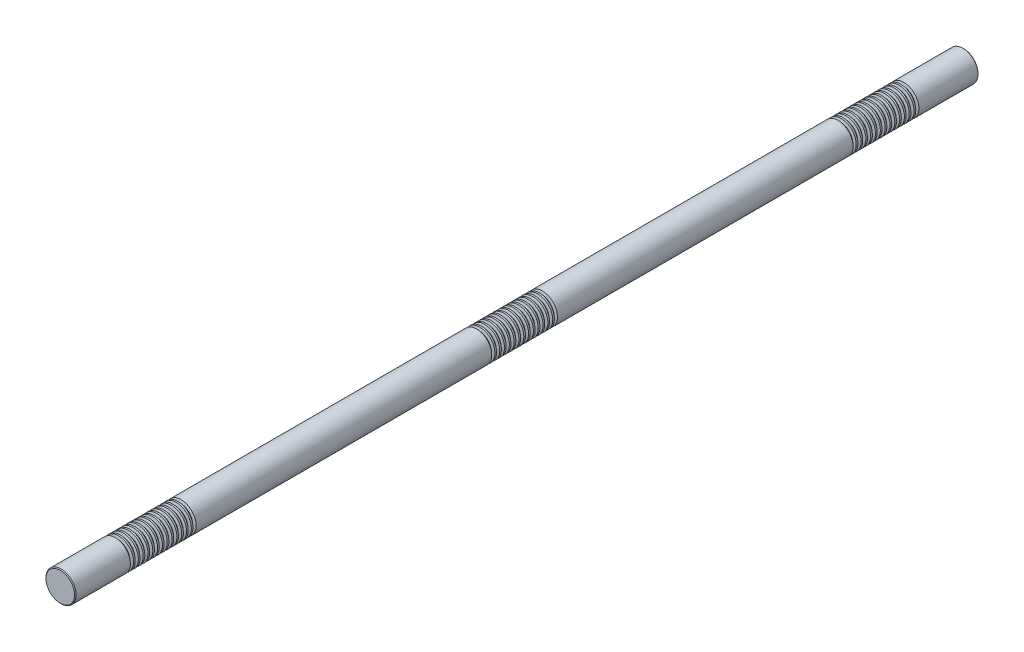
from build123d import *

# Parameters (mm, degrees)
SKETCH1_R           = 25
BOSS_EXTRUDE1_DEPTH = 750
CHAMFER1_SIZE       = 1.25
LPATTERN1_COUNT     = 14
LPATTERN1_PITCH     = 8
LPATTERN2_COUNT     = 3
LPATTERN2_PITCH     = 600


with BuildPart() as part:
    # Sketch1 → Boss-Extrude1 (new, symmetric)
    with BuildSketch(Plane.XY):
        Circle(SKETCH1_R)
    extrude(amount=BOSS_EXTRUDE1_DEPTH, both=True)

    # Chamfer1
    chamfer1_edges = [part.edges().sort_by_distance(p)[0] for p in [
        (-25, 0, -750),
        (-25, 0, 750),
    ]]
    chamfer(chamfer1_edges, length=CHAMFER1_SIZE)

    # Sketch2 → Cut-Revolve1 (revolve, cut)
    with BuildSketch(Plane(origin=(0, 0, 0), x_dir=(0, 0, -1), z_dir=(1, 0, 0)), mode=Mode.PRIVATE) as cut_revolve1_sk:
        Polygon((650.602885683, 25), (645.397114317, 25), (646.602885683, 20.5), (649.397114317, 20.5), align=None)
    cut_revolve1 = revolve(cut_revolve1_sk.sketch.rotate(Axis((0, 0, 750), (0, 0, -1)), 90), axis=Axis((0, 0, 750), (0, 0, -1)), mode=Mode.SUBTRACT)

    # LPattern1: Cut-Revolve1 ×14
    with Locations(*[(0, 0, i * LPATTERN1_PITCH) for i in range(1, LPATTERN1_COUNT)]):
        add(cut_revolve1, mode=Mode.SUBTRACT)

    # LPattern2: Cut-Revolve1 ×3
    with Locations(*[(0, 0, i * LPATTERN2_PITCH) for i in range(1, LPATTERN2_COUNT)]):
        add(cut_revolve1, mode=Mode.SUBTRACT)

    # LPattern2 copy 1 sketch → LPattern2 copy 1 (revolve, cut)
    with BuildSketch(Plane(origin=(0, 0, 608), x_dir=(0, 0, -1), z_dir=(1, 0, 0))):
        Polygon((650.602885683, 25), (645.397114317, 25), (646.602885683, 20.5), (649.397114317, 20.5), align=None)
    revolve(axis=Axis((0, 0, 1358), (0, 0, -1)), mode=Mode.SUBTRACT)

    # LPattern2 copy 2 sketch → LPattern2 copy 2 (revolve, cut)
    with BuildSketch(Plane(origin=(0, 0, 1208), x_dir=(0, 0, -1), z_dir=(1, 0, 0))):
        Polygon((650.602885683, 25), (645.397114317, 25), (646.602885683, 20.5), (649.397114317, 20.5), align=None)
    revolve(axis=Axis((0, 0, 1958), (0, 0, -1)), mode=Mode.SUBTRACT)

    # LPattern2 copy 3 sketch → LPattern2 copy 3 (revolve, cut)
    with BuildSketch(Plane(origin=(0, 0, 616), x_dir=(0, 0, -1), z_dir=(1, 0, 0))):
        Polygon((650.602885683, 25), (645.397114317, 25), (646.602885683, 20.5), (649.397114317, 20.5), align=None)
    revolve(axis=Axis((0, 0, 1366), (0, 0, -1)), mode=Mode.SUBTRACT)

    # LPattern2 copy 4 sketch → LPattern2 copy 4 (revolve, cut)
    with BuildSketch(Plane(origin=(0, 0, 1216), x_dir=(0, 0, -1), z_dir=(1, 0, 0))):
        Polygon((650.602885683, 25), (645.397114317, 25), (646.602885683, 20.5), (649.397114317, 20.5), align=None)
    revolve(axis=Axis((0, 0, 1966), (0, 0, -1)), mode=Mode.SUBTRACT)

    # LPattern2 copy 5 sketch → LPattern2 copy 5 (revolve, cut)
    with BuildSketch(Plane(origin=(0, 0, 624), x_dir=(0, 0, -1), z_dir=(1, 0, 0))):
        Polygon((650.602885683, 25), (645.397114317, 25), (646.602885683, 20.5), (649.397114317, 20.5), align=None)
    revolve(axis=Axis((0, 0, 1374), (0, 0, -1)), mode=Mode.SUBTRACT)

    # LPattern2 copy 6 sketch → LPattern2 copy 6 (revolve, cut)
    with BuildSketch(Plane(origin=(0, 0, 1224), x_dir=(0, 0, -1), z_dir=(1, 0, 0))):
        Polygon((650.602885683, 25), (645.397114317, 25), (646.602885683, 20.5), (649.397114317, 20.5), align=None)
    revolve(axis=Axis((0, 0, 1974), (0, 0, -1)), mode=Mode.SUBTRACT)

    # LPattern2 copy 7 sketch → LPattern2 copy 7 (revolve, cut)
    with BuildSketch(Plane(origin=(0, 0, 632), x_dir=(0, 0, -1), z_dir=(1, 0, 0))):
        Polygon((650.602885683, 25), (645.397114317, 25), (646.602885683, 20.5), (649.397114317, 20.5), align=None)
    revolve(axis=Axis((0, 0, 1382), (0, 0, -1)), mode=Mode.SUBTRACT)

    # LPattern2 copy 8 sketch → LPattern2 copy 8 (revolve, cut)
    with BuildSketch(Plane(origin=(0, 0, 1232), x_dir=(0, 0, -1), z_dir=(1, 0, 0))):
        Polygon((650.602885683, 25), (645.397114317, 25), (646.602885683, 20.5), (649.397114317, 20.5), align=None)
    revolve(axis=Axis((0, 0, 1982), (0, 0, -1)), mode=Mode.SUBTRACT)

    # LPattern2 copy 9 sketch → LPattern2 copy 9 (revolve, cut)
    with BuildSketch(Plane(origin=(0, 0, 640), x_dir=(0, 0, -1), z_dir=(1, 0, 0))):
        Polygon((650.602885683, 25), (645.397114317, 25), (646.602885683, 20.5), (649.397114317, 20.5), align=None)
    revolve(axis=Axis((0, 0, 1390), (0, 0, -1)), mode=Mode.SUBTRACT)

    # LPattern2 copy 10 sketch → LPattern2 copy 10 (revolve, cut)
    with BuildSketch(Plane(origin=(0, 0, 1240), x_dir=(0, 0, -1), z_dir=(1, 0, 0))):
        Polygon((650.602885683, 25), (645.397114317, 25), (646.602885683, 20.5), (649.397114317, 20.5), align=None)
    revolve(axis=Axis((0, 0, 1990), (0, 0, -1)), mode=Mode.SUBTRACT)

    # LPattern2 copy 11 sketch → LPattern2 copy 11 (revolve, cut)
    with BuildSketch(Plane(origin=(0, 0, 648), x_dir=(0, 0, -1), z_dir=(1, 0, 0))):
        Polygon((650.602885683, 25), (645.397114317, 25), (646.602885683, 20.5), (649.397114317, 20.5), align=None)
    revolve(axis=Axis((0, 0, 1398), (0, 0, -1)), mode=Mode.SUBTRACT)

    # LPattern2 copy 12 sketch → LPattern2 copy 12 (revolve, cut)
    with BuildSketch(Plane(origin=(0, 0, 1248), x_dir=(0, 0, -1), z_dir=(1, 0, 0))):
        Polygon((650.602885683, 25), (645.397114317, 25), (646.602885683, 20.5), (649.397114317, 20.5), align=None)
    revolve(axis=Axis((0, 0, 1998), (0, 0, -1)), mode=Mode.SUBTRACT)

    # LPattern2 copy 13 sketch → LPattern2 copy 13 (revolve, cut)
    with BuildSketch(Plane(origin=(0, 0, 656), x_dir=(0, 0, -1), z_dir=(1, 0, 0))):
        Polygon((650.602885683, 25), (645.397114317, 25), (646.602885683, 20.5), (649.397114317, 20.5), align=None)
    revolve(axis=Axis((0, 0, 1406), (0, 0, -1)), mode=Mode.SUBTRACT)

    # LPattern2 copy 14 sketch → LPattern2 copy 14 (revolve, cut)
    with BuildSketch(Plane(origin=(0, 0, 1256), x_dir=(0, 0, -1), z_dir=(1, 0, 0))):
        Polygon((650.602885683, 25), (645.397114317, 25), (646.602885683, 20.5), (649.397114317, 20.5), align=None)
    revolve(axis=Axis((0, 0, 2006), (0, 0, -1)), mode=Mode.SUBTRACT)

    # LPattern2 copy 15 sketch → LPattern2 copy 15 (revolve, cut)
    with BuildSketch(Plane(origin=(0, 0, 664), x_dir=(0, 0, -1), z_dir=(1, 0, 0))):
        Polygon((650.602885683, 25), (645.397114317, 25), (646.602885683, 20.5), (649.397114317, 20.5), align=None)
    revolve(axis=Axis((0, 0, 1414), (0, 0, -1)), mode=Mode.SUBTRACT)

    # LPattern2 copy 16 sketch → LPattern2 copy 16 (revolve, cut)
    with BuildSketch(Plane(origin=(0, 0, 1264), x_dir=(0, 0, -1), z_dir=(1, 0, 0))):
        Polygon((650.602885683, 25), (645.397114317, 25), (646.602885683, 20.5), (649.397114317, 20.5), align=None)
    revolve(axis=Axis((0, 0, 2014), (0, 0, -1)), mode=Mode.SUBTRACT)

    # LPattern2 copy 17 sketch → LPattern2 copy 17 (revolve, cut)
    with BuildSketch(Plane(origin=(0, 0, 672), x_dir=(0, 0, -1), z_dir=(1, 0, 0))):
        Polygon((650.602885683, 25), (645.397114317, 25), (646.602885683, 20.5), (649.397114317, 20.5), align=None)
    revolve(axis=Axis((0, 0, 1422), (0, 0, -1)), mode=Mode.SUBTRACT)

    # LPattern2 copy 18 sketch → LPattern2 copy 18 (revolve, cut)
    with BuildSketch(Plane(origin=(0, 0, 1272), x_dir=(0, 0, -1), z_dir=(1, 0, 0))):
        Polygon((650.602885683, 25), (645.397114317, 25), (646.602885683, 20.5), (649.397114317, 20.5), align=None)
    revolve(axis=Axis((0, 0, 2022), (0, 0, -1)), mode=Mode.SUBTRACT)

    # LPattern2 copy 19 sketch → LPattern2 copy 19 (revolve, cut)
    with BuildSketch(Plane(origin=(0, 0, 680), x_dir=(0, 0, -1), z_dir=(1, 0, 0))):
        Polygon((650.602885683, 25), (645.397114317, 25), (646.602885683, 20.5), (649.397114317, 20.5), align=None)
    revolve(axis=Axis((0, 0, 1430), (0, 0, -1)), mode=Mode.SUBTRACT)

    # LPattern2 copy 20 sketch → LPattern2 copy 20 (revolve, cut)
    with BuildSketch(Plane(origin=(0, 0, 1280), x_dir=(0, 0, -1), z_dir=(1, 0, 0))):
        Polygon((650.602885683, 25), (645.397114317, 25), (646.602885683, 20.5), (649.397114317, 20.5), align=None)
    revolve(axis=Axis((0, 0, 2030), (0, 0, -1)), mode=Mode.SUBTRACT)

    # LPattern2 copy 21 sketch → LPattern2 copy 21 (revolve, cut)
    with BuildSketch(Plane(origin=(0, 0, 688), x_dir=(0, 0, -1), z_dir=(1, 0, 0))):
        Polygon((650.602885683, 25), (645.397114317, 25), (646.602885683, 20.5), (649.397114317, 20.5), align=None)
    revolve(axis=Axis((0, 0, 1438), (0, 0, -1)), mode=Mode.SUBTRACT)

    # LPattern2 copy 22 sketch → LPattern2 copy 22 (revolve, cut)
    with BuildSketch(Plane(origin=(0, 0, 1288), x_dir=(0, 0, -1), z_dir=(1, 0, 0))):
        Polygon((650.602885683, 25), (645.397114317, 25), (646.602885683, 20.5), (649.397114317, 20.5), align=None)
    revolve(axis=Axis((0, 0, 2038), (0, 0, -1)), mode=Mode.SUBTRACT)

    # LPattern2 copy 23 sketch → LPattern2 copy 23 (revolve, cut)
    with BuildSketch(Plane(origin=(0, 0, 696), x_dir=(0, 0, -1), z_dir=(1, 0, 0))):
        Polygon((650.602885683, 25), (645.397114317, 25), (646.602885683, 20.5), (649.397114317, 20.5), align=None)
    revolve(axis=Axis((0, 0, 1446), (0, 0, -1)), mode=Mode.SUBTRACT)

    # LPattern2 copy 24 sketch → LPattern2 copy 24 (revolve, cut)
    with BuildSketch(Plane(origin=(0, 0, 1296), x_dir=(0, 0, -1), z_dir=(1, 0, 0))):
        Polygon((650.602885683, 25), (645.397114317, 25), (646.602885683, 20.5), (649.397114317, 20.5), align=None)
    revolve(axis=Axis((0, 0, 2046), (0, 0, -1)), mode=Mode.SUBTRACT)

    # LPattern2 copy 25 sketch → LPattern2 copy 25 (revolve, cut)
    with BuildSketch(Plane(origin=(0, 0, 704), x_dir=(0, 0, -1), z_dir=(1, 0, 0))):
        Polygon((650.602885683, 25), (645.397114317, 25), (646.602885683, 20.5), (649.397114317, 20.5), align=None)
    revolve(axis=Axis((0, 0, 1454), (0, 0, -1)), mode=Mode.SUBTRACT)

    # LPattern2 copy 26 sketch → LPattern2 copy 26 (revolve, cut)
    with BuildSketch(Plane(origin=(0, 0, 1304), x_dir=(0, 0, -1), z_dir=(1, 0, 0))):
        Polygon((650.602885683, 25), (645.397114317, 25), (646.602885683, 20.5), (649.397114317, 20.5), align=None)
    revolve(axis=Axis((0, 0, 2054), (0, 0, -1)), mode=Mode.SUBTRACT)


solid = part.part
